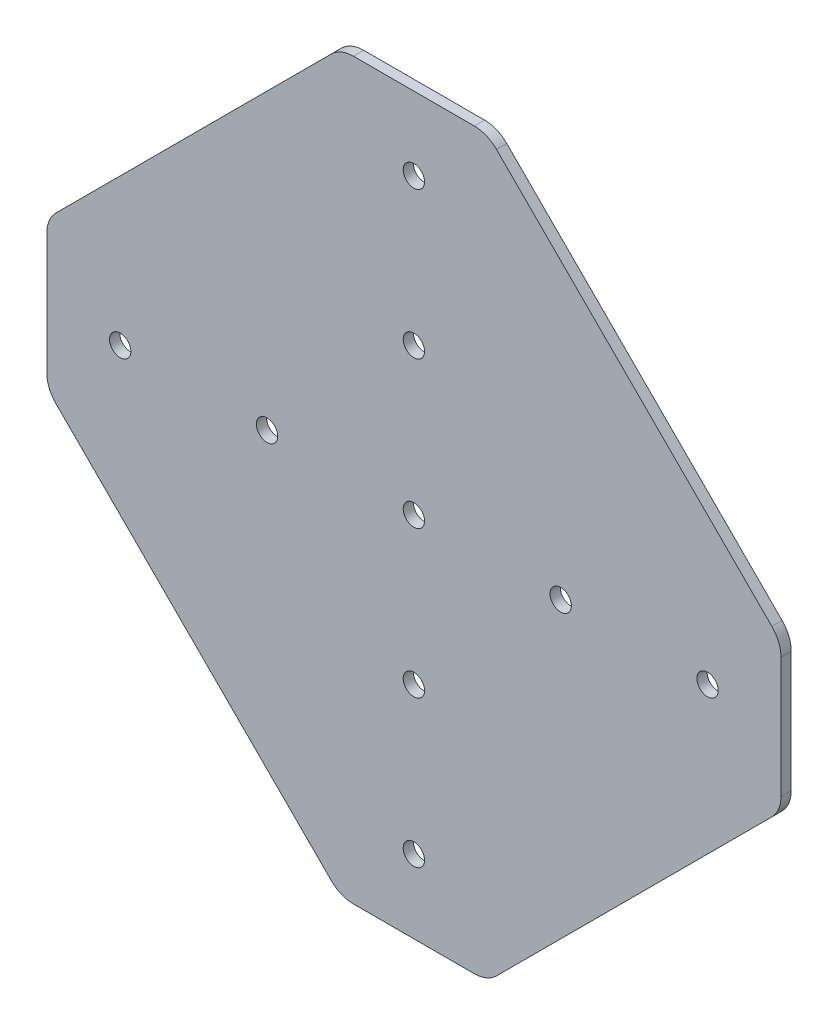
ISO-10303-21;
HEADER;
FILE_DESCRIPTION(('STEP AP214'),'2;1');
FILE_NAME('part.step','',(''),(''),'','','');
FILE_SCHEMA(('AUTOMOTIVE_DESIGN { 1 0 10303 214 1 1 1 1 }'));
ENDSEC;
DATA;
#1=APPLICATION_CONTEXT('core data for automotive mechanical design processes');
#2=APPLICATION_PROTOCOL_DEFINITION('international standard','automotive_design',2000,#1);
#3=PRODUCT_CONTEXT('',#1,'mechanical');
#4=PRODUCT('Part','Part','',(#3));
#5=PRODUCT_RELATED_PRODUCT_CATEGORY('part','',(#4));
#6=PRODUCT_DEFINITION_FORMATION('','',#4);
#7=PRODUCT_DEFINITION_CONTEXT('part definition',#1,'design');
#8=PRODUCT_DEFINITION('design','',#6,#7);
#9=PRODUCT_DEFINITION_SHAPE('','',#8);
#10=(LENGTH_UNIT() NAMED_UNIT(*) SI_UNIT(.MILLI.,.METRE.));
#11=(NAMED_UNIT(*) PLANE_ANGLE_UNIT() SI_UNIT($,.RADIAN.));
#12=(NAMED_UNIT(*) SI_UNIT($,.STERADIAN.) SOLID_ANGLE_UNIT());
#13=UNCERTAINTY_MEASURE_WITH_UNIT(LENGTH_MEASURE(1.E-05),#10,'distance_accuracy_value','');
#14=(GEOMETRIC_REPRESENTATION_CONTEXT(3) GLOBAL_UNCERTAINTY_ASSIGNED_CONTEXT((#13)) GLOBAL_UNIT_ASSIGNED_CONTEXT((#10,
#11,#12)) REPRESENTATION_CONTEXT('',''));
#15=CARTESIAN_POINT('',(0.,0.,0.));
#16=DIRECTION('',(0.,0.,1.));
#17=DIRECTION('',(1.,0.,0.));
#18=AXIS2_PLACEMENT_3D('',#15,#16,#17);
#19=CARTESIAN_POINT('',(0.,-68.1990000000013,0.));
#20=DIRECTION('',(0.,0.,-1.));
#21=DIRECTION('',(-1.,0.,0.));
#22=AXIS2_PLACEMENT_3D('',#19,#20,#21);
#23=PLANE('',#22);
#24=CARTESIAN_POINT('',(-45.466,0.,0.));
#25=DIRECTION('',(0.,0.,1.));
#26=DIRECTION('',(1.,0.,0.));
#27=AXIS2_PLACEMENT_3D('',#24,#25,#26);
#28=CIRCLE('',#27,1.651);
#29=CARTESIAN_POINT('',(-43.815,0.,0.));
#30=VERTEX_POINT('',#29);
#31=EDGE_CURVE('E20',#30,#30,#28,.T.);
#32=ORIENTED_EDGE('',*,*,#31,.T.);
#33=EDGE_LOOP('',(#32));
#34=FACE_BOUND('',#33,.T.);
#35=CARTESIAN_POINT('',(45.466,0.,0.));
#36=DIRECTION('',(0.,0.,1.));
#37=DIRECTION('',(1.,0.,0.));
#38=AXIS2_PLACEMENT_3D('',#35,#36,#37);
#39=CIRCLE('',#38,1.651);
#40=CARTESIAN_POINT('',(47.117,0.,0.));
#41=VERTEX_POINT('',#40);
#42=EDGE_CURVE('E272',#41,#41,#39,.T.);
#43=ORIENTED_EDGE('',*,*,#42,.T.);
#44=EDGE_LOOP('',(#43));
#45=FACE_BOUND('',#44,.T.);
#46=CARTESIAN_POINT('',(0.,-22.7330000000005,0.));
#47=DIRECTION('',(0.,0.,1.));
#48=DIRECTION('',(1.,0.,0.));
#49=AXIS2_PLACEMENT_3D('',#46,#47,#48);
#50=CIRCLE('',#49,1.651);
#51=CARTESIAN_POINT('',(1.651,-22.7330000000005,0.));
#52=VERTEX_POINT('',#51);
#53=EDGE_CURVE('E270',#52,#52,#50,.T.);
#54=ORIENTED_EDGE('',*,*,#53,.T.);
#55=EDGE_LOOP('',(#54));
#56=FACE_BOUND('',#55,.T.);
#57=CARTESIAN_POINT('',(-22.733,0.,0.));
#58=DIRECTION('',(0.,0.,1.));
#59=DIRECTION('',(1.,0.,0.));
#60=AXIS2_PLACEMENT_3D('',#57,#58,#59);
#61=CIRCLE('',#60,1.651);
#62=CARTESIAN_POINT('',(-21.082,0.,0.));
#63=VERTEX_POINT('',#62);
#64=EDGE_CURVE('E141',#63,#63,#61,.T.);
#65=ORIENTED_EDGE('',*,*,#64,.T.);
#66=EDGE_LOOP('',(#65));
#67=FACE_BOUND('',#66,.T.);
#68=DIRECTION('',(-0.707106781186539,-0.707106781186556,0.));
#69=VECTOR('',#68,1.);
#70=CARTESIAN_POINT('',(56.8325,-11.3665,0.));
#71=LINE('',#70,#69);
#72=CARTESIAN_POINT('',(55.4143476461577,-12.7846523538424,0.));
#73=VERTEX_POINT('',#72);
#74=CARTESIAN_POINT('',(12.7846523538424,-55.4143476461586,0.));
#75=VERTEX_POINT('',#74);
#76=EDGE_CURVE('E164',#73,#75,#71,.T.);
#77=ORIENTED_EDGE('',*,*,#76,.T.);
#78=CARTESIAN_POINT('',(9.36092970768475,-51.9906250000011,0.));
#79=DIRECTION('',(0.,0.,-1.));
#80=DIRECTION('',(-1.,0.,0.));
#81=AXIS2_PLACEMENT_3D('',#78,#79,#80);
#82=CIRCLE('',#81,4.841875);
#83=CARTESIAN_POINT('',(9.36092970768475,-56.8325000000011,0.));
#84=VERTEX_POINT('',#83);
#85=EDGE_CURVE('E166',#84,#75,#82,.F.);
#86=ORIENTED_EDGE('',*,*,#85,.F.);
#87=DIRECTION('',(1.,0.,0.));
#88=VECTOR('',#87,1.);
#89=CARTESIAN_POINT('',(11.3665,-56.8325000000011,0.));
#90=LINE('',#89,#88);
#91=CARTESIAN_POINT('',(-9.36092970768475,-56.8325000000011,0.));
#92=VERTEX_POINT('',#91);
#93=EDGE_CURVE('E159',#84,#92,#90,.F.);
#94=ORIENTED_EDGE('',*,*,#93,.T.);
#95=CARTESIAN_POINT('',(-9.36092970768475,-51.9906250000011,0.));
#96=DIRECTION('',(0.,0.,-1.));
#97=DIRECTION('',(-1.,0.,0.));
#98=AXIS2_PLACEMENT_3D('',#95,#96,#97);
#99=CIRCLE('',#98,4.841875);
#100=CARTESIAN_POINT('',(-12.7846523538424,-55.4143476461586,0.));
#101=VERTEX_POINT('',#100);
#102=EDGE_CURVE('E162',#101,#92,#99,.F.);
#103=ORIENTED_EDGE('',*,*,#102,.F.);
#104=DIRECTION('',(-0.707106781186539,0.707106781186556,0.));
#105=VECTOR('',#104,1.);
#106=CARTESIAN_POINT('',(-56.8325,-11.3665,0.));
#107=LINE('',#106,#105);
#108=CARTESIAN_POINT('',(-55.4143476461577,-12.7846523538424,0.));
#109=VERTEX_POINT('',#108);
#110=EDGE_CURVE('E135',#101,#109,#107,.T.);
#111=ORIENTED_EDGE('',*,*,#110,.T.);
#112=CARTESIAN_POINT('',(-51.990625,-9.36092970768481,0.));
#113=DIRECTION('',(0.,0.,-1.));
#114=DIRECTION('',(-1.,0.,0.));
#115=AXIS2_PLACEMENT_3D('',#112,#113,#114);
#116=CIRCLE('',#115,4.841875);
#117=CARTESIAN_POINT('',(-56.8325,-9.36092970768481,0.));
#118=VERTEX_POINT('',#117);
#119=EDGE_CURVE('E129',#118,#109,#116,.F.);
#120=ORIENTED_EDGE('',*,*,#119,.F.);
#121=DIRECTION('',(0.,1.,0.));
#122=VECTOR('',#121,1.);
#123=CARTESIAN_POINT('',(-56.8325,-11.3665,0.));
#124=LINE('',#123,#122);
#125=CARTESIAN_POINT('',(-56.8325,9.36092970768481,0.));
#126=VERTEX_POINT('',#125);
#127=EDGE_CURVE('E133',#118,#126,#124,.T.);
#128=ORIENTED_EDGE('',*,*,#127,.T.);
#129=CARTESIAN_POINT('',(-51.990625,9.36092970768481,0.));
#130=DIRECTION('',(0.,0.,-1.));
#131=DIRECTION('',(-1.,0.,0.));
#132=AXIS2_PLACEMENT_3D('',#129,#130,#131);
#133=CIRCLE('',#132,4.841875);
#134=CARTESIAN_POINT('',(-55.4143476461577,12.7846523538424,0.));
#135=VERTEX_POINT('',#134);
#136=EDGE_CURVE('E148',#135,#126,#133,.F.);
#137=ORIENTED_EDGE('',*,*,#136,.F.);
#138=DIRECTION('',(0.707106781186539,0.707106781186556,0.));
#139=VECTOR('',#138,1.);
#140=CARTESIAN_POINT('',(-56.8325,11.3665,0.));
#141=LINE('',#140,#139);
#142=CARTESIAN_POINT('',(-12.7846523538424,55.4143476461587,0.));
#143=VERTEX_POINT('',#142);
#144=EDGE_CURVE('E183',#135,#143,#141,.T.);
#145=ORIENTED_EDGE('',*,*,#144,.T.);
#146=CARTESIAN_POINT('',(-9.36092970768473,51.9906250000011,0.));
#147=DIRECTION('',(0.,0.,-1.));
#148=DIRECTION('',(-1.,0.,0.));
#149=AXIS2_PLACEMENT_3D('',#146,#147,#148);
#150=CIRCLE('',#149,4.841875);
#151=CARTESIAN_POINT('',(-9.36092970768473,56.8325000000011,0.));
#152=VERTEX_POINT('',#151);
#153=EDGE_CURVE('E185',#152,#143,#150,.F.);
#154=ORIENTED_EDGE('',*,*,#153,.F.);
#155=DIRECTION('',(1.,0.,0.));
#156=VECTOR('',#155,1.);
#157=CARTESIAN_POINT('',(11.3665,56.8325000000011,0.));
#158=LINE('',#157,#156);
#159=CARTESIAN_POINT('',(9.36092970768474,56.8325000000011,0.));
#160=VERTEX_POINT('',#159);
#161=EDGE_CURVE('E178',#152,#160,#158,.T.);
#162=ORIENTED_EDGE('',*,*,#161,.T.);
#163=CARTESIAN_POINT('',(9.36092970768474,51.9906250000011,0.));
#164=DIRECTION('',(0.,0.,-1.));
#165=DIRECTION('',(-1.,0.,0.));
#166=AXIS2_PLACEMENT_3D('',#163,#164,#165);
#167=CIRCLE('',#166,4.841875);
#168=CARTESIAN_POINT('',(12.7846523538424,55.4143476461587,0.));
#169=VERTEX_POINT('',#168);
#170=EDGE_CURVE('E181',#169,#160,#167,.F.);
#171=ORIENTED_EDGE('',*,*,#170,.F.);
#172=DIRECTION('',(0.707106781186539,-0.707106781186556,0.));
#173=VECTOR('',#172,1.);
#174=CARTESIAN_POINT('',(56.8325,11.3665,0.));
#175=LINE('',#174,#173);
#176=CARTESIAN_POINT('',(55.4143476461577,12.7846523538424,0.));
#177=VERTEX_POINT('',#176);
#178=EDGE_CURVE('E173',#169,#177,#175,.T.);
#179=ORIENTED_EDGE('',*,*,#178,.T.);
#180=CARTESIAN_POINT('',(51.990625,9.36092970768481,0.));
#181=DIRECTION('',(0.,0.,-1.));
#182=DIRECTION('',(-1.,0.,0.));
#183=AXIS2_PLACEMENT_3D('',#180,#181,#182);
#184=CIRCLE('',#183,4.841875);
#185=CARTESIAN_POINT('',(56.8325,9.36092970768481,0.));
#186=VERTEX_POINT('',#185);
#187=EDGE_CURVE('E176',#186,#177,#184,.F.);
#188=ORIENTED_EDGE('',*,*,#187,.F.);
#189=DIRECTION('',(0.,1.,0.));
#190=VECTOR('',#189,1.);
#191=CARTESIAN_POINT('',(56.8325,-11.3665,0.));
#192=LINE('',#191,#190);
#193=CARTESIAN_POINT('',(56.8325,-9.36092970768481,0.));
#194=VERTEX_POINT('',#193);
#195=EDGE_CURVE('E168',#186,#194,#192,.F.);
#196=ORIENTED_EDGE('',*,*,#195,.T.);
#197=CARTESIAN_POINT('',(51.990625,-9.36092970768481,0.));
#198=DIRECTION('',(0.,0.,-1.));
#199=DIRECTION('',(-1.,0.,0.));
#200=AXIS2_PLACEMENT_3D('',#197,#198,#199);
#201=CIRCLE('',#200,4.841875);
#202=EDGE_CURVE('E171',#73,#194,#201,.F.);
#203=ORIENTED_EDGE('',*,*,#202,.F.);
#204=EDGE_LOOP('',(#77,#86,#94,#103,#111,#120,#128,#137,#145,#154,#162,#171,#179,#188,#196,#203));
#205=FACE_BOUND('',#204,.T.);
#206=CARTESIAN_POINT('',(22.733,0.,0.));
#207=DIRECTION('',(0.,0.,1.));
#208=DIRECTION('',(1.,0.,0.));
#209=AXIS2_PLACEMENT_3D('',#206,#207,#208);
#210=CIRCLE('',#209,1.651);
#211=CARTESIAN_POINT('',(24.384,0.,0.));
#212=VERTEX_POINT('',#211);
#213=EDGE_CURVE('E158',#212,#212,#210,.T.);
#214=ORIENTED_EDGE('',*,*,#213,.T.);
#215=EDGE_LOOP('',(#214));
#216=FACE_BOUND('',#215,.T.);
#217=CARTESIAN_POINT('',(0.,45.4660000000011,0.));
#218=DIRECTION('',(0.,0.,1.));
#219=DIRECTION('',(1.,0.,0.));
#220=AXIS2_PLACEMENT_3D('',#217,#218,#219);
#221=CIRCLE('',#220,1.651);
#222=CARTESIAN_POINT('',(1.65100000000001,45.4660000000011,0.));
#223=VERTEX_POINT('',#222);
#224=EDGE_CURVE('E250',#223,#223,#221,.T.);
#225=ORIENTED_EDGE('',*,*,#224,.T.);
#226=EDGE_LOOP('',(#225));
#227=FACE_BOUND('',#226,.T.);
#228=CARTESIAN_POINT('',(0.,-45.4660000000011,0.));
#229=DIRECTION('',(0.,0.,1.));
#230=DIRECTION('',(1.,0.,0.));
#231=AXIS2_PLACEMENT_3D('',#228,#229,#230);
#232=CIRCLE('',#231,1.651);
#233=CARTESIAN_POINT('',(1.651,-45.4660000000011,0.));
#234=VERTEX_POINT('',#233);
#235=EDGE_CURVE('E247',#234,#234,#232,.T.);
#236=ORIENTED_EDGE('',*,*,#235,.T.);
#237=EDGE_LOOP('',(#236));
#238=FACE_BOUND('',#237,.T.);
#239=CARTESIAN_POINT('',(0.,0.,0.));
#240=DIRECTION('',(0.,0.,1.));
#241=DIRECTION('',(1.,0.,0.));
#242=AXIS2_PLACEMENT_3D('',#239,#240,#241);
#243=CIRCLE('',#242,1.651);
#244=CARTESIAN_POINT('',(1.651,0.,0.));
#245=VERTEX_POINT('',#244);
#246=EDGE_CURVE('E244',#245,#245,#243,.T.);
#247=ORIENTED_EDGE('',*,*,#246,.T.);
#248=EDGE_LOOP('',(#247));
#249=FACE_BOUND('',#248,.T.);
#250=CARTESIAN_POINT('',(0.,22.7330000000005,0.));
#251=DIRECTION('',(0.,0.,1.));
#252=DIRECTION('',(1.,0.,0.));
#253=AXIS2_PLACEMENT_3D('',#250,#251,#252);
#254=CIRCLE('',#253,1.651);
#255=CARTESIAN_POINT('',(1.651,22.7330000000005,0.));
#256=VERTEX_POINT('',#255);
#257=EDGE_CURVE('E241',#256,#256,#254,.T.);
#258=ORIENTED_EDGE('',*,*,#257,.T.);
#259=EDGE_LOOP('',(#258));
#260=FACE_BOUND('',#259,.T.);
#261=ADVANCED_FACE('F17',(#34,#45,#56,#67,#205,#216,#227,#238,#249,#260),#23,.T.);
#262=CARTESIAN_POINT('',(-45.466,0.,1.5875));
#263=DIRECTION('',(0.,0.,1.));
#264=DIRECTION('',(1.,0.,0.));
#265=AXIS2_PLACEMENT_3D('',#262,#263,#264);
#266=CYLINDRICAL_SURFACE('',#265,1.651);
#267=ORIENTED_EDGE('',*,*,#31,.F.);
#268=EDGE_LOOP('',(#267));
#269=FACE_BOUND('',#268,.T.);
#270=CARTESIAN_POINT('',(-45.466,0.,1.5875));
#271=DIRECTION('',(0.,0.,1.));
#272=DIRECTION('',(1.,0.,0.));
#273=AXIS2_PLACEMENT_3D('',#270,#271,#272);
#274=CIRCLE('',#273,1.651);
#275=CARTESIAN_POINT('',(-43.815,0.,1.5875));
#276=VERTEX_POINT('',#275);
#277=EDGE_CURVE('E238',#276,#276,#274,.T.);
#278=ORIENTED_EDGE('',*,*,#277,.T.);
#279=EDGE_LOOP('',(#278));
#280=FACE_BOUND('',#279,.T.);
#281=ADVANCED_FACE('F280',(#269,#280),#266,.F.);
#282=CARTESIAN_POINT('',(45.466,0.,1.5875));
#283=DIRECTION('',(0.,0.,1.));
#284=DIRECTION('',(1.,0.,0.));
#285=AXIS2_PLACEMENT_3D('',#282,#283,#284);
#286=CYLINDRICAL_SURFACE('',#285,1.651);
#287=ORIENTED_EDGE('',*,*,#42,.F.);
#288=EDGE_LOOP('',(#287));
#289=FACE_BOUND('',#288,.T.);
#290=CARTESIAN_POINT('',(45.466,0.,1.5875));
#291=DIRECTION('',(0.,0.,1.));
#292=DIRECTION('',(1.,0.,0.));
#293=AXIS2_PLACEMENT_3D('',#290,#291,#292);
#294=CIRCLE('',#293,1.651);
#295=CARTESIAN_POINT('',(47.117,0.,1.5875));
#296=VERTEX_POINT('',#295);
#297=EDGE_CURVE('E235',#296,#296,#294,.T.);
#298=ORIENTED_EDGE('',*,*,#297,.T.);
#299=EDGE_LOOP('',(#298));
#300=FACE_BOUND('',#299,.T.);
#301=ADVANCED_FACE('F283',(#289,#300),#286,.F.);
#302=CARTESIAN_POINT('',(0.,-22.7330000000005,1.5875));
#303=DIRECTION('',(0.,0.,1.));
#304=DIRECTION('',(1.,0.,0.));
#305=AXIS2_PLACEMENT_3D('',#302,#303,#304);
#306=CYLINDRICAL_SURFACE('',#305,1.651);
#307=ORIENTED_EDGE('',*,*,#53,.F.);
#308=EDGE_LOOP('',(#307));
#309=FACE_BOUND('',#308,.T.);
#310=CARTESIAN_POINT('',(0.,-22.7330000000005,1.5875));
#311=DIRECTION('',(0.,0.,1.));
#312=DIRECTION('',(1.,0.,0.));
#313=AXIS2_PLACEMENT_3D('',#310,#311,#312);
#314=CIRCLE('',#313,1.651);
#315=CARTESIAN_POINT('',(1.651,-22.7330000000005,1.5875));
#316=VERTEX_POINT('',#315);
#317=EDGE_CURVE('E232',#316,#316,#314,.T.);
#318=ORIENTED_EDGE('',*,*,#317,.T.);
#319=EDGE_LOOP('',(#318));
#320=FACE_BOUND('',#319,.T.);
#321=ADVANCED_FACE('F378',(#309,#320),#306,.F.);
#322=CARTESIAN_POINT('',(-22.733,0.,1.5875));
#323=DIRECTION('',(0.,0.,1.));
#324=DIRECTION('',(1.,0.,0.));
#325=AXIS2_PLACEMENT_3D('',#322,#323,#324);
#326=CYLINDRICAL_SURFACE('',#325,1.651);
#327=ORIENTED_EDGE('',*,*,#64,.F.);
#328=EDGE_LOOP('',(#327));
#329=FACE_BOUND('',#328,.T.);
#330=CARTESIAN_POINT('',(-22.733,0.,1.5875));
#331=DIRECTION('',(0.,0.,1.));
#332=DIRECTION('',(1.,0.,0.));
#333=AXIS2_PLACEMENT_3D('',#330,#331,#332);
#334=CIRCLE('',#333,1.651);
#335=CARTESIAN_POINT('',(-21.082,0.,1.5875));
#336=VERTEX_POINT('',#335);
#337=EDGE_CURVE('E229',#336,#336,#334,.T.);
#338=ORIENTED_EDGE('',*,*,#337,.T.);
#339=EDGE_LOOP('',(#338));
#340=FACE_BOUND('',#339,.T.);
#341=ADVANCED_FACE('F375',(#329,#340),#326,.F.);
#342=CARTESIAN_POINT('',(-51.990625,-9.36092970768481,1.5875));
#343=DIRECTION('',(0.,0.,-1.));
#344=DIRECTION('',(-1.,0.,0.));
#345=AXIS2_PLACEMENT_3D('',#342,#343,#344);
#346=CYLINDRICAL_SURFACE('',#345,4.841875);
#347=ORIENTED_EDGE('',*,*,#119,.T.);
#348=DIRECTION('',(0.,0.,1.));
#349=VECTOR('',#348,1.);
#350=CARTESIAN_POINT('',(-55.4143476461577,-12.7846523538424,1.5875));
#351=LINE('',#350,#349);
#352=CARTESIAN_POINT('',(-55.4143476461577,-12.7846523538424,1.5875));
#353=VERTEX_POINT('',#352);
#354=EDGE_CURVE('E593',#109,#353,#351,.T.);
#355=ORIENTED_EDGE('',*,*,#354,.T.);
#356=CARTESIAN_POINT('',(-51.990625,-9.36092970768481,1.5875));
#357=DIRECTION('',(0.,0.,-1.));
#358=DIRECTION('',(-1.,0.,0.));
#359=AXIS2_PLACEMENT_3D('',#356,#357,#358);
#360=CIRCLE('',#359,4.841875);
#361=CARTESIAN_POINT('',(-56.8325,-9.36092970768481,1.5875));
#362=VERTEX_POINT('',#361);
#363=EDGE_CURVE('E152',#353,#362,#360,.T.);
#364=ORIENTED_EDGE('',*,*,#363,.T.);
#365=DIRECTION('',(0.,0.,-1.));
#366=VECTOR('',#365,1.);
#367=CARTESIAN_POINT('',(-56.8325,-9.36092970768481,1.5875));
#368=LINE('',#367,#366);
#369=EDGE_CURVE('E140',#362,#118,#368,.T.);
#370=ORIENTED_EDGE('',*,*,#369,.T.);
#371=EDGE_LOOP('',(#347,#355,#364,#370));
#372=FACE_BOUND('',#371,.T.);
#373=ADVANCED_FACE('F151',(#372),#346,.T.);
#374=CARTESIAN_POINT('',(-56.8325,-11.3665,1.5875));
#375=DIRECTION('',(1.,0.,0.));
#376=DIRECTION('',(0.,0.,-1.));
#377=AXIS2_PLACEMENT_3D('',#374,#375,#376);
#378=PLANE('',#377);
#379=ORIENTED_EDGE('',*,*,#369,.F.);
#380=DIRECTION('',(0.,1.,0.));
#381=VECTOR('',#380,1.);
#382=CARTESIAN_POINT('',(-56.8325,-68.1990000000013,1.5875));
#383=LINE('',#382,#381);
#384=CARTESIAN_POINT('',(-56.8325,9.36092970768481,1.5875));
#385=VERTEX_POINT('',#384);
#386=EDGE_CURVE('E227',#362,#385,#383,.T.);
#387=ORIENTED_EDGE('',*,*,#386,.T.);
#388=DIRECTION('',(0.,0.,-1.));
#389=VECTOR('',#388,1.);
#390=CARTESIAN_POINT('',(-56.8325,9.36092970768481,1.5875));
#391=LINE('',#390,#389);
#392=EDGE_CURVE('E147',#126,#385,#391,.F.);
#393=ORIENTED_EDGE('',*,*,#392,.F.);
#394=ORIENTED_EDGE('',*,*,#127,.F.);
#395=EDGE_LOOP('',(#379,#387,#393,#394));
#396=FACE_BOUND('',#395,.T.);
#397=ADVANCED_FACE('F144',(#396),#378,.F.);
#398=CARTESIAN_POINT('',(-51.990625,9.36092970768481,1.5875));
#399=DIRECTION('',(0.,0.,-1.));
#400=DIRECTION('',(-1.,0.,0.));
#401=AXIS2_PLACEMENT_3D('',#398,#399,#400);
#402=CYLINDRICAL_SURFACE('',#401,4.841875);
#403=ORIENTED_EDGE('',*,*,#136,.T.);
#404=ORIENTED_EDGE('',*,*,#392,.T.);
#405=CARTESIAN_POINT('',(-51.990625,9.36092970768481,1.5875));
#406=DIRECTION('',(0.,0.,-1.));
#407=DIRECTION('',(-1.,0.,0.));
#408=AXIS2_PLACEMENT_3D('',#405,#406,#407);
#409=CIRCLE('',#408,4.841875);
#410=CARTESIAN_POINT('',(-55.4143476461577,12.7846523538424,1.5875));
#411=VERTEX_POINT('',#410);
#412=EDGE_CURVE('E224',#385,#411,#409,.T.);
#413=ORIENTED_EDGE('',*,*,#412,.T.);
#414=DIRECTION('',(0.,0.,1.));
#415=VECTOR('',#414,1.);
#416=CARTESIAN_POINT('',(-55.4143476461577,12.7846523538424,1.5875));
#417=LINE('',#416,#415);
#418=EDGE_CURVE('E186',#411,#135,#417,.F.);
#419=ORIENTED_EDGE('',*,*,#418,.T.);
#420=EDGE_LOOP('',(#403,#404,#413,#419));
#421=FACE_BOUND('',#420,.T.);
#422=ADVANCED_FACE('F366',(#421),#402,.T.);
#423=CARTESIAN_POINT('',(-56.8325,11.3665,1.5875));
#424=DIRECTION('',(0.707106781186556,-0.707106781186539,0.));
#425=DIRECTION('',(0.707106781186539,0.707106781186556,0.));
#426=AXIS2_PLACEMENT_3D('',#423,#424,#425);
#427=PLANE('',#426);
#428=DIRECTION('',(0.,0.,-1.));
#429=VECTOR('',#428,1.);
#430=CARTESIAN_POINT('',(-12.7846523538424,55.4143476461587,1.5875));
#431=LINE('',#430,#429);
#432=CARTESIAN_POINT('',(-12.7846523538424,55.4143476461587,1.5875));
#433=VERTEX_POINT('',#432);
#434=EDGE_CURVE('E266',#143,#433,#431,.F.);
#435=ORIENTED_EDGE('',*,*,#434,.F.);
#436=ORIENTED_EDGE('',*,*,#144,.F.);
#437=ORIENTED_EDGE('',*,*,#418,.F.);
#438=DIRECTION('',(0.707106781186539,0.707106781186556,0.));
#439=VECTOR('',#438,1.);
#440=CARTESIAN_POINT('',(-55.4143476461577,12.7846523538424,1.5875));
#441=LINE('',#440,#439);
#442=EDGE_CURVE('E223',#411,#433,#441,.T.);
#443=ORIENTED_EDGE('',*,*,#442,.T.);
#444=EDGE_LOOP('',(#435,#436,#437,#443));
#445=FACE_BOUND('',#444,.T.);
#446=ADVANCED_FACE('F362',(#445),#427,.F.);
#447=CARTESIAN_POINT('',(-9.36092970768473,51.9906250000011,1.5875));
#448=DIRECTION('',(0.,0.,-1.));
#449=DIRECTION('',(-1.,0.,0.));
#450=AXIS2_PLACEMENT_3D('',#447,#448,#449);
#451=CYLINDRICAL_SURFACE('',#450,4.841875);
#452=ORIENTED_EDGE('',*,*,#153,.T.);
#453=ORIENTED_EDGE('',*,*,#434,.T.);
#454=CARTESIAN_POINT('',(-9.36092970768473,51.9906250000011,1.5875));
#455=DIRECTION('',(0.,0.,-1.));
#456=DIRECTION('',(-1.,0.,0.));
#457=AXIS2_PLACEMENT_3D('',#454,#455,#456);
#458=CIRCLE('',#457,4.841875);
#459=CARTESIAN_POINT('',(-9.36092970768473,56.8325000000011,1.5875));
#460=VERTEX_POINT('',#459);
#461=EDGE_CURVE('E220',#433,#460,#458,.T.);
#462=ORIENTED_EDGE('',*,*,#461,.T.);
#463=DIRECTION('',(0.,0.,-1.));
#464=VECTOR('',#463,1.);
#465=CARTESIAN_POINT('',(-9.36092970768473,56.8325000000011,1.5875));
#466=LINE('',#465,#464);
#467=EDGE_CURVE('E182',#460,#152,#466,.T.);
#468=ORIENTED_EDGE('',*,*,#467,.T.);
#469=EDGE_LOOP('',(#452,#453,#462,#468));
#470=FACE_BOUND('',#469,.T.);
#471=ADVANCED_FACE('F358',(#470),#451,.T.);
#472=CARTESIAN_POINT('',(11.3665,56.8325000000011,1.5875));
#473=DIRECTION('',(0.,-1.,0.));
#474=DIRECTION('',(0.,0.,-1.));
#475=AXIS2_PLACEMENT_3D('',#472,#473,#474);
#476=PLANE('',#475);
#477=DIRECTION('',(0.,0.,-1.));
#478=VECTOR('',#477,1.);
#479=CARTESIAN_POINT('',(9.36092970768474,56.8325000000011,1.5875));
#480=LINE('',#479,#478);
#481=CARTESIAN_POINT('',(9.36092970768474,56.8325000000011,1.5875));
#482=VERTEX_POINT('',#481);
#483=EDGE_CURVE('E264',#160,#482,#480,.F.);
#484=ORIENTED_EDGE('',*,*,#483,.F.);
#485=ORIENTED_EDGE('',*,*,#161,.F.);
#486=ORIENTED_EDGE('',*,*,#467,.F.);
#487=DIRECTION('',(-1.,0.,0.));
#488=VECTOR('',#487,1.);
#489=CARTESIAN_POINT('',(0.,56.8325000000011,1.5875));
#490=LINE('',#489,#488);
#491=EDGE_CURVE('E219',#460,#482,#490,.F.);
#492=ORIENTED_EDGE('',*,*,#491,.T.);
#493=EDGE_LOOP('',(#484,#485,#486,#492));
#494=FACE_BOUND('',#493,.T.);
#495=ADVANCED_FACE('F354',(#494),#476,.F.);
#496=CARTESIAN_POINT('',(9.36092970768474,51.9906250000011,1.5875));
#497=DIRECTION('',(0.,0.,-1.));
#498=DIRECTION('',(-1.,0.,0.));
#499=AXIS2_PLACEMENT_3D('',#496,#497,#498);
#500=CYLINDRICAL_SURFACE('',#499,4.841875);
#501=ORIENTED_EDGE('',*,*,#170,.T.);
#502=ORIENTED_EDGE('',*,*,#483,.T.);
#503=CARTESIAN_POINT('',(9.36092970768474,51.9906250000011,1.5875));
#504=DIRECTION('',(0.,0.,-1.));
#505=DIRECTION('',(-1.,0.,0.));
#506=AXIS2_PLACEMENT_3D('',#503,#504,#505);
#507=CIRCLE('',#506,4.841875);
#508=CARTESIAN_POINT('',(12.7846523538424,55.4143476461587,1.5875));
#509=VERTEX_POINT('',#508);
#510=EDGE_CURVE('E216',#482,#509,#507,.T.);
#511=ORIENTED_EDGE('',*,*,#510,.T.);
#512=DIRECTION('',(0.,0.,1.));
#513=VECTOR('',#512,1.);
#514=CARTESIAN_POINT('',(12.7846523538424,55.4143476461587,1.5875));
#515=LINE('',#514,#513);
#516=EDGE_CURVE('E177',#509,#169,#515,.F.);
#517=ORIENTED_EDGE('',*,*,#516,.T.);
#518=EDGE_LOOP('',(#501,#502,#511,#517));
#519=FACE_BOUND('',#518,.T.);
#520=ADVANCED_FACE('F350',(#519),#500,.T.);
#521=CARTESIAN_POINT('',(56.8325,11.3665,1.5875));
#522=DIRECTION('',(-0.707106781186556,-0.707106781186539,0.));
#523=DIRECTION('',(0.707106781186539,-0.707106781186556,0.));
#524=AXIS2_PLACEMENT_3D('',#521,#522,#523);
#525=PLANE('',#524);
#526=DIRECTION('',(0.,0.,-1.));
#527=VECTOR('',#526,1.);
#528=CARTESIAN_POINT('',(55.4143476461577,12.7846523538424,1.5875));
#529=LINE('',#528,#527);
#530=CARTESIAN_POINT('',(55.4143476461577,12.7846523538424,1.5875));
#531=VERTEX_POINT('',#530);
#532=EDGE_CURVE('E262',#177,#531,#529,.F.);
#533=ORIENTED_EDGE('',*,*,#532,.F.);
#534=ORIENTED_EDGE('',*,*,#178,.F.);
#535=ORIENTED_EDGE('',*,*,#516,.F.);
#536=DIRECTION('',(0.707106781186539,-0.707106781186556,0.));
#537=VECTOR('',#536,1.);
#538=CARTESIAN_POINT('',(12.7846523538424,55.4143476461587,1.5875));
#539=LINE('',#538,#537);
#540=EDGE_CURVE('E215',#509,#531,#539,.T.);
#541=ORIENTED_EDGE('',*,*,#540,.T.);
#542=EDGE_LOOP('',(#533,#534,#535,#541));
#543=FACE_BOUND('',#542,.T.);
#544=ADVANCED_FACE('F346',(#543),#525,.F.);
#545=CARTESIAN_POINT('',(51.990625,9.36092970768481,1.5875));
#546=DIRECTION('',(0.,0.,-1.));
#547=DIRECTION('',(-1.,0.,0.));
#548=AXIS2_PLACEMENT_3D('',#545,#546,#547);
#549=CYLINDRICAL_SURFACE('',#548,4.841875);
#550=ORIENTED_EDGE('',*,*,#187,.T.);
#551=ORIENTED_EDGE('',*,*,#532,.T.);
#552=CARTESIAN_POINT('',(51.990625,9.36092970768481,1.5875));
#553=DIRECTION('',(0.,0.,-1.));
#554=DIRECTION('',(-1.,0.,0.));
#555=AXIS2_PLACEMENT_3D('',#552,#553,#554);
#556=CIRCLE('',#555,4.841875);
#557=CARTESIAN_POINT('',(56.8325,9.36092970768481,1.5875));
#558=VERTEX_POINT('',#557);
#559=EDGE_CURVE('E212',#531,#558,#556,.T.);
#560=ORIENTED_EDGE('',*,*,#559,.T.);
#561=DIRECTION('',(0.,0.,1.));
#562=VECTOR('',#561,1.);
#563=CARTESIAN_POINT('',(56.8325,9.36092970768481,1.5875));
#564=LINE('',#563,#562);
#565=EDGE_CURVE('E172',#558,#186,#564,.F.);
#566=ORIENTED_EDGE('',*,*,#565,.T.);
#567=EDGE_LOOP('',(#550,#551,#560,#566));
#568=FACE_BOUND('',#567,.T.);
#569=ADVANCED_FACE('F342',(#568),#549,.T.);
#570=CARTESIAN_POINT('',(56.8325,-11.3665,1.5875));
#571=DIRECTION('',(-1.,0.,0.));
#572=DIRECTION('',(0.,0.,1.));
#573=AXIS2_PLACEMENT_3D('',#570,#571,#572);
#574=PLANE('',#573);
#575=DIRECTION('',(0.,0.,-1.));
#576=VECTOR('',#575,1.);
#577=CARTESIAN_POINT('',(56.8325,-9.36092970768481,1.5875));
#578=LINE('',#577,#576);
#579=CARTESIAN_POINT('',(56.8325,-9.36092970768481,1.5875));
#580=VERTEX_POINT('',#579);
#581=EDGE_CURVE('E260',#194,#580,#578,.F.);
#582=ORIENTED_EDGE('',*,*,#581,.F.);
#583=ORIENTED_EDGE('',*,*,#195,.F.);
#584=ORIENTED_EDGE('',*,*,#565,.F.);
#585=DIRECTION('',(0.,1.,0.));
#586=VECTOR('',#585,1.);
#587=CARTESIAN_POINT('',(56.8325,-68.1990000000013,1.5875));
#588=LINE('',#587,#586);
#589=EDGE_CURVE('E211',#558,#580,#588,.F.);
#590=ORIENTED_EDGE('',*,*,#589,.T.);
#591=EDGE_LOOP('',(#582,#583,#584,#590));
#592=FACE_BOUND('',#591,.T.);
#593=ADVANCED_FACE('F338',(#592),#574,.F.);
#594=CARTESIAN_POINT('',(51.990625,-9.36092970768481,1.5875));
#595=DIRECTION('',(0.,0.,-1.));
#596=DIRECTION('',(-1.,0.,0.));
#597=AXIS2_PLACEMENT_3D('',#594,#595,#596);
#598=CYLINDRICAL_SURFACE('',#597,4.841875);
#599=ORIENTED_EDGE('',*,*,#202,.T.);
#600=ORIENTED_EDGE('',*,*,#581,.T.);
#601=CARTESIAN_POINT('',(51.990625,-9.36092970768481,1.5875));
#602=DIRECTION('',(0.,0.,-1.));
#603=DIRECTION('',(-1.,0.,0.));
#604=AXIS2_PLACEMENT_3D('',#601,#602,#603);
#605=CIRCLE('',#604,4.841875);
#606=CARTESIAN_POINT('',(55.4143476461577,-12.7846523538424,1.5875));
#607=VERTEX_POINT('',#606);
#608=EDGE_CURVE('E208',#580,#607,#605,.T.);
#609=ORIENTED_EDGE('',*,*,#608,.T.);
#610=DIRECTION('',(0.,0.,1.));
#611=VECTOR('',#610,1.);
#612=CARTESIAN_POINT('',(55.4143476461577,-12.7846523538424,1.5875));
#613=LINE('',#612,#611);
#614=EDGE_CURVE('E167',#607,#73,#613,.F.);
#615=ORIENTED_EDGE('',*,*,#614,.T.);
#616=EDGE_LOOP('',(#599,#600,#609,#615));
#617=FACE_BOUND('',#616,.T.);
#618=ADVANCED_FACE('F334',(#617),#598,.T.);
#619=CARTESIAN_POINT('',(56.8325,-11.3665,1.5875));
#620=DIRECTION('',(-0.707106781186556,0.707106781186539,0.));
#621=DIRECTION('',(-0.707106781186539,-0.707106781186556,0.));
#622=AXIS2_PLACEMENT_3D('',#619,#620,#621);
#623=PLANE('',#622);
#624=DIRECTION('',(0.,0.,-1.));
#625=VECTOR('',#624,1.);
#626=CARTESIAN_POINT('',(12.7846523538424,-55.4143476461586,1.5875));
#627=LINE('',#626,#625);
#628=CARTESIAN_POINT('',(12.7846523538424,-55.4143476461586,1.5875));
#629=VERTEX_POINT('',#628);
#630=EDGE_CURVE('E258',#75,#629,#627,.F.);
#631=ORIENTED_EDGE('',*,*,#630,.F.);
#632=ORIENTED_EDGE('',*,*,#76,.F.);
#633=ORIENTED_EDGE('',*,*,#614,.F.);
#634=DIRECTION('',(-0.707106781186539,-0.707106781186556,0.));
#635=VECTOR('',#634,1.);
#636=CARTESIAN_POINT('',(55.4143476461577,-12.7846523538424,1.5875));
#637=LINE('',#636,#635);
#638=EDGE_CURVE('E207',#607,#629,#637,.T.);
#639=ORIENTED_EDGE('',*,*,#638,.T.);
#640=EDGE_LOOP('',(#631,#632,#633,#639));
#641=FACE_BOUND('',#640,.T.);
#642=ADVANCED_FACE('F330',(#641),#623,.F.);
#643=CARTESIAN_POINT('',(9.36092970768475,-51.9906250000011,1.5875));
#644=DIRECTION('',(0.,0.,-1.));
#645=DIRECTION('',(-1.,0.,0.));
#646=AXIS2_PLACEMENT_3D('',#643,#644,#645);
#647=CYLINDRICAL_SURFACE('',#646,4.841875);
#648=ORIENTED_EDGE('',*,*,#85,.T.);
#649=ORIENTED_EDGE('',*,*,#630,.T.);
#650=CARTESIAN_POINT('',(9.36092970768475,-51.9906250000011,1.5875));
#651=DIRECTION('',(0.,0.,-1.));
#652=DIRECTION('',(-1.,0.,0.));
#653=AXIS2_PLACEMENT_3D('',#650,#651,#652);
#654=CIRCLE('',#653,4.841875);
#655=CARTESIAN_POINT('',(9.36092970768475,-56.8325000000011,1.5875));
#656=VERTEX_POINT('',#655);
#657=EDGE_CURVE('E204',#629,#656,#654,.T.);
#658=ORIENTED_EDGE('',*,*,#657,.T.);
#659=DIRECTION('',(0.,0.,1.));
#660=VECTOR('',#659,1.);
#661=CARTESIAN_POINT('',(9.36092970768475,-56.8325000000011,1.5875));
#662=LINE('',#661,#660);
#663=EDGE_CURVE('E163',#656,#84,#662,.F.);
#664=ORIENTED_EDGE('',*,*,#663,.T.);
#665=EDGE_LOOP('',(#648,#649,#658,#664));
#666=FACE_BOUND('',#665,.T.);
#667=ADVANCED_FACE('F326',(#666),#647,.T.);
#668=CARTESIAN_POINT('',(11.3665,-56.8325000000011,1.5875));
#669=DIRECTION('',(0.,1.,0.));
#670=DIRECTION('',(0.,0.,1.));
#671=AXIS2_PLACEMENT_3D('',#668,#669,#670);
#672=PLANE('',#671);
#673=DIRECTION('',(0.,0.,-1.));
#674=VECTOR('',#673,1.);
#675=CARTESIAN_POINT('',(-9.36092970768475,-56.8325000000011,1.5875));
#676=LINE('',#675,#674);
#677=CARTESIAN_POINT('',(-9.36092970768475,-56.8325000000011,1.5875));
#678=VERTEX_POINT('',#677);
#679=EDGE_CURVE('E256',#92,#678,#676,.F.);
#680=ORIENTED_EDGE('',*,*,#679,.F.);
#681=ORIENTED_EDGE('',*,*,#93,.F.);
#682=ORIENTED_EDGE('',*,*,#663,.F.);
#683=DIRECTION('',(-1.,0.,0.));
#684=VECTOR('',#683,1.);
#685=CARTESIAN_POINT('',(0.,-56.8325000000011,1.5875));
#686=LINE('',#685,#684);
#687=EDGE_CURVE('E203',#656,#678,#686,.T.);
#688=ORIENTED_EDGE('',*,*,#687,.T.);
#689=EDGE_LOOP('',(#680,#681,#682,#688));
#690=FACE_BOUND('',#689,.T.);
#691=ADVANCED_FACE('F322',(#690),#672,.F.);
#692=CARTESIAN_POINT('',(-9.36092970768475,-51.9906250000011,1.5875));
#693=DIRECTION('',(0.,0.,-1.));
#694=DIRECTION('',(-1.,0.,0.));
#695=AXIS2_PLACEMENT_3D('',#692,#693,#694);
#696=CYLINDRICAL_SURFACE('',#695,4.841875);
#697=ORIENTED_EDGE('',*,*,#102,.T.);
#698=ORIENTED_EDGE('',*,*,#679,.T.);
#699=CARTESIAN_POINT('',(-9.36092970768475,-51.9906250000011,1.5875));
#700=DIRECTION('',(0.,0.,-1.));
#701=DIRECTION('',(-1.,0.,0.));
#702=AXIS2_PLACEMENT_3D('',#699,#700,#701);
#703=CIRCLE('',#702,4.841875);
#704=CARTESIAN_POINT('',(-12.7846523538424,-55.4143476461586,1.5875));
#705=VERTEX_POINT('',#704);
#706=EDGE_CURVE('E200',#678,#705,#703,.T.);
#707=ORIENTED_EDGE('',*,*,#706,.T.);
#708=DIRECTION('',(0.,0.,1.));
#709=VECTOR('',#708,1.);
#710=CARTESIAN_POINT('',(-12.7846523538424,-55.4143476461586,1.5875));
#711=LINE('',#710,#709);
#712=EDGE_CURVE('E35',#705,#101,#711,.F.);
#713=ORIENTED_EDGE('',*,*,#712,.T.);
#714=EDGE_LOOP('',(#697,#698,#707,#713));
#715=FACE_BOUND('',#714,.T.);
#716=ADVANCED_FACE('F319',(#715),#696,.T.);
#717=CARTESIAN_POINT('',(-56.8325,-11.3665,1.5875));
#718=DIRECTION('',(0.707106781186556,0.707106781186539,0.));
#719=DIRECTION('',(-0.707106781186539,0.707106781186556,0.));
#720=AXIS2_PLACEMENT_3D('',#717,#718,#719);
#721=PLANE('',#720);
#722=ORIENTED_EDGE('',*,*,#712,.F.);
#723=DIRECTION('',(-0.707106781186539,0.707106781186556,0.));
#724=VECTOR('',#723,1.);
#725=CARTESIAN_POINT('',(-12.7846523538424,-55.4143476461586,1.5875));
#726=LINE('',#725,#724);
#727=EDGE_CURVE('E199',#705,#353,#726,.T.);
#728=ORIENTED_EDGE('',*,*,#727,.T.);
#729=ORIENTED_EDGE('',*,*,#354,.F.);
#730=ORIENTED_EDGE('',*,*,#110,.F.);
#731=EDGE_LOOP('',(#722,#728,#729,#730));
#732=FACE_BOUND('',#731,.T.);
#733=ADVANCED_FACE('F315',(#732),#721,.F.);
#734=CARTESIAN_POINT('',(22.733,0.,1.5875));
#735=DIRECTION('',(0.,0.,1.));
#736=DIRECTION('',(1.,0.,0.));
#737=AXIS2_PLACEMENT_3D('',#734,#735,#736);
#738=CYLINDRICAL_SURFACE('',#737,1.651);
#739=ORIENTED_EDGE('',*,*,#213,.F.);
#740=EDGE_LOOP('',(#739));
#741=FACE_BOUND('',#740,.T.);
#742=CARTESIAN_POINT('',(22.733,0.,1.5875));
#743=DIRECTION('',(0.,0.,1.));
#744=DIRECTION('',(1.,0.,0.));
#745=AXIS2_PLACEMENT_3D('',#742,#743,#744);
#746=CIRCLE('',#745,1.651);
#747=CARTESIAN_POINT('',(24.384,0.,1.5875));
#748=VERTEX_POINT('',#747);
#749=EDGE_CURVE('E196',#748,#748,#746,.T.);
#750=ORIENTED_EDGE('',*,*,#749,.T.);
#751=EDGE_LOOP('',(#750));
#752=FACE_BOUND('',#751,.T.);
#753=ADVANCED_FACE('F311',(#741,#752),#738,.F.);
#754=CARTESIAN_POINT('',(0.,45.4660000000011,1.5875));
#755=DIRECTION('',(0.,0.,1.));
#756=DIRECTION('',(1.,0.,0.));
#757=AXIS2_PLACEMENT_3D('',#754,#755,#756);
#758=CYLINDRICAL_SURFACE('',#757,1.651);
#759=ORIENTED_EDGE('',*,*,#224,.F.);
#760=EDGE_LOOP('',(#759));
#761=FACE_BOUND('',#760,.T.);
#762=CARTESIAN_POINT('',(0.,45.4660000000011,1.5875));
#763=DIRECTION('',(0.,0.,1.));
#764=DIRECTION('',(1.,0.,0.));
#765=AXIS2_PLACEMENT_3D('',#762,#763,#764);
#766=CIRCLE('',#765,1.651);
#767=CARTESIAN_POINT('',(1.65100000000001,45.4660000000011,1.5875));
#768=VERTEX_POINT('',#767);
#769=EDGE_CURVE('E193',#768,#768,#766,.T.);
#770=ORIENTED_EDGE('',*,*,#769,.T.);
#771=EDGE_LOOP('',(#770));
#772=FACE_BOUND('',#771,.T.);
#773=ADVANCED_FACE('F307',(#761,#772),#758,.F.);
#774=CARTESIAN_POINT('',(0.,-45.4660000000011,1.5875));
#775=DIRECTION('',(0.,0.,1.));
#776=DIRECTION('',(1.,0.,0.));
#777=AXIS2_PLACEMENT_3D('',#774,#775,#776);
#778=CYLINDRICAL_SURFACE('',#777,1.651);
#779=ORIENTED_EDGE('',*,*,#235,.F.);
#780=EDGE_LOOP('',(#779));
#781=FACE_BOUND('',#780,.T.);
#782=CARTESIAN_POINT('',(0.,-45.4660000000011,1.5875));
#783=DIRECTION('',(0.,0.,1.));
#784=DIRECTION('',(1.,0.,0.));
#785=AXIS2_PLACEMENT_3D('',#782,#783,#784);
#786=CIRCLE('',#785,1.651);
#787=CARTESIAN_POINT('',(1.651,-45.4660000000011,1.5875));
#788=VERTEX_POINT('',#787);
#789=EDGE_CURVE('E190',#788,#788,#786,.T.);
#790=ORIENTED_EDGE('',*,*,#789,.T.);
#791=EDGE_LOOP('',(#790));
#792=FACE_BOUND('',#791,.T.);
#793=ADVANCED_FACE('F303',(#781,#792),#778,.F.);
#794=CARTESIAN_POINT('',(0.,0.,1.5875));
#795=DIRECTION('',(0.,0.,1.));
#796=DIRECTION('',(1.,0.,0.));
#797=AXIS2_PLACEMENT_3D('',#794,#795,#796);
#798=CYLINDRICAL_SURFACE('',#797,1.651);
#799=ORIENTED_EDGE('',*,*,#246,.F.);
#800=EDGE_LOOP('',(#799));
#801=FACE_BOUND('',#800,.T.);
#802=CARTESIAN_POINT('',(0.,0.,1.5875));
#803=DIRECTION('',(0.,0.,1.));
#804=DIRECTION('',(1.,0.,0.));
#805=AXIS2_PLACEMENT_3D('',#802,#803,#804);
#806=CIRCLE('',#805,1.651);
#807=CARTESIAN_POINT('',(1.651,0.,1.5875));
#808=VERTEX_POINT('',#807);
#809=EDGE_CURVE('E26',#808,#808,#806,.T.);
#810=ORIENTED_EDGE('',*,*,#809,.T.);
#811=EDGE_LOOP('',(#810));
#812=FACE_BOUND('',#811,.T.);
#813=ADVANCED_FACE('F295',(#801,#812),#798,.F.);
#814=CARTESIAN_POINT('',(0.,22.7330000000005,1.5875));
#815=DIRECTION('',(0.,0.,1.));
#816=DIRECTION('',(1.,0.,0.));
#817=AXIS2_PLACEMENT_3D('',#814,#815,#816);
#818=CYLINDRICAL_SURFACE('',#817,1.651);
#819=ORIENTED_EDGE('',*,*,#257,.F.);
#820=EDGE_LOOP('',(#819));
#821=FACE_BOUND('',#820,.T.);
#822=CARTESIAN_POINT('',(0.,22.7330000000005,1.5875));
#823=DIRECTION('',(0.,0.,1.));
#824=DIRECTION('',(1.,0.,0.));
#825=AXIS2_PLACEMENT_3D('',#822,#823,#824);
#826=CIRCLE('',#825,1.651);
#827=CARTESIAN_POINT('',(1.651,22.7330000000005,1.5875));
#828=VERTEX_POINT('',#827);
#829=EDGE_CURVE('E10',#828,#828,#826,.T.);
#830=ORIENTED_EDGE('',*,*,#829,.T.);
#831=EDGE_LOOP('',(#830));
#832=FACE_BOUND('',#831,.T.);
#833=ADVANCED_FACE('F288',(#821,#832),#818,.F.);
#834=CARTESIAN_POINT('',(0.,-68.1990000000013,1.5875));
#835=DIRECTION('',(0.,0.,-1.));
#836=DIRECTION('',(-1.,0.,0.));
#837=AXIS2_PLACEMENT_3D('',#834,#835,#836);
#838=PLANE('',#837);
#839=ORIENTED_EDGE('',*,*,#829,.F.);
#840=EDGE_LOOP('',(#839));
#841=FACE_BOUND('',#840,.T.);
#842=ORIENTED_EDGE('',*,*,#809,.F.);
#843=EDGE_LOOP('',(#842));
#844=FACE_BOUND('',#843,.T.);
#845=ORIENTED_EDGE('',*,*,#789,.F.);
#846=EDGE_LOOP('',(#845));
#847=FACE_BOUND('',#846,.T.);
#848=ORIENTED_EDGE('',*,*,#769,.F.);
#849=EDGE_LOOP('',(#848));
#850=FACE_BOUND('',#849,.T.);
#851=ORIENTED_EDGE('',*,*,#749,.F.);
#852=EDGE_LOOP('',(#851));
#853=FACE_BOUND('',#852,.T.);
#854=ORIENTED_EDGE('',*,*,#706,.F.);
#855=ORIENTED_EDGE('',*,*,#687,.F.);
#856=ORIENTED_EDGE('',*,*,#657,.F.);
#857=ORIENTED_EDGE('',*,*,#638,.F.);
#858=ORIENTED_EDGE('',*,*,#608,.F.);
#859=ORIENTED_EDGE('',*,*,#589,.F.);
#860=ORIENTED_EDGE('',*,*,#559,.F.);
#861=ORIENTED_EDGE('',*,*,#540,.F.);
#862=ORIENTED_EDGE('',*,*,#510,.F.);
#863=ORIENTED_EDGE('',*,*,#491,.F.);
#864=ORIENTED_EDGE('',*,*,#461,.F.);
#865=ORIENTED_EDGE('',*,*,#442,.F.);
#866=ORIENTED_EDGE('',*,*,#412,.F.);
#867=ORIENTED_EDGE('',*,*,#386,.F.);
#868=ORIENTED_EDGE('',*,*,#363,.F.);
#869=ORIENTED_EDGE('',*,*,#727,.F.);
#870=EDGE_LOOP('',(#854,#855,#856,#857,#858,#859,#860,#861,#862,#863,#864,#865,#866,#867,#868,#869));
#871=FACE_BOUND('',#870,.T.);
#872=ORIENTED_EDGE('',*,*,#337,.F.);
#873=EDGE_LOOP('',(#872));
#874=FACE_BOUND('',#873,.T.);
#875=ORIENTED_EDGE('',*,*,#317,.F.);
#876=EDGE_LOOP('',(#875));
#877=FACE_BOUND('',#876,.T.);
#878=ORIENTED_EDGE('',*,*,#297,.F.);
#879=EDGE_LOOP('',(#878));
#880=FACE_BOUND('',#879,.T.);
#881=ORIENTED_EDGE('',*,*,#277,.F.);
#882=EDGE_LOOP('',(#881));
#883=FACE_BOUND('',#882,.T.);
#884=ADVANCED_FACE('F286',(#841,#844,#847,#850,#853,#871,#874,#877,#880,#883),#838,.F.);
#885=CLOSED_SHELL('',(#261,#281,#301,#321,#341,#373,#397,#422,#446,#471,#495,#520,#544,#569,
#593,#618,#642,#667,#691,#716,#733,#753,#773,#793,#813,#833,#884));
#886=MANIFOLD_SOLID_BREP('B1',#885);
#887=ADVANCED_BREP_SHAPE_REPRESENTATION('',(#18,#886),#14);
#888=SHAPE_DEFINITION_REPRESENTATION(#9,#887);
ENDSEC;
END-ISO-10303-21;
